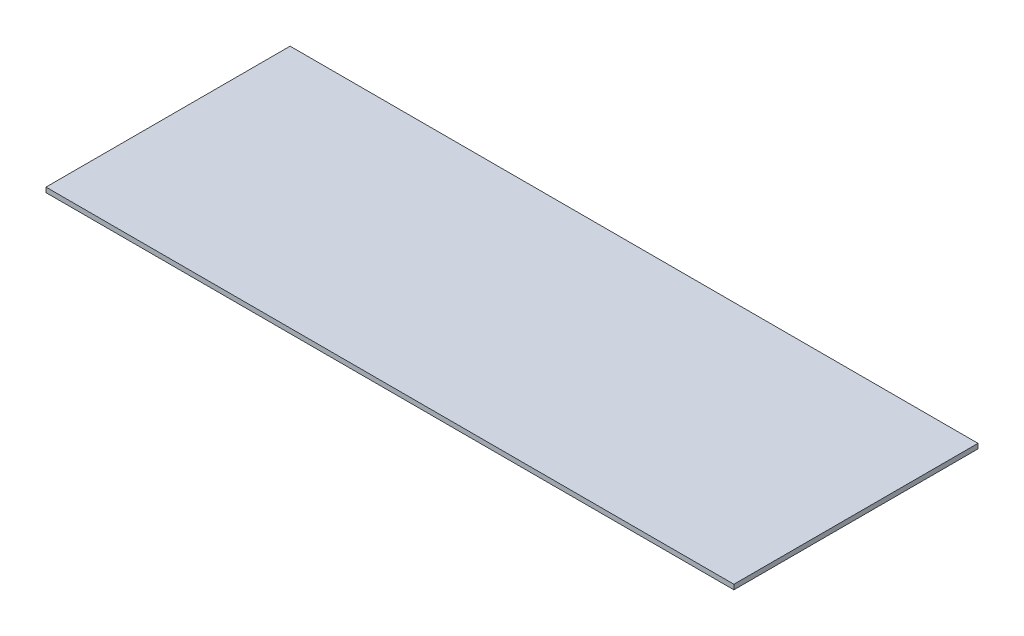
from build123d import *

# Parameters (mm, degrees)
SKETCH1_W           = 787.4
SKETCH1_H           = 279.4
BOSS_EXTRUDE1_DEPTH = 5.55625


with BuildPart() as part:
    # Sketch1 → Boss-Extrude1 (new body)
    with BuildSketch(Plane(origin=(0, 0, 0), x_dir=(1, 0, 0), z_dir=(0, 1, 0))):
        Rectangle(SKETCH1_W, SKETCH1_H)
    extrude(amount=BOSS_EXTRUDE1_DEPTH)


solid = part.part
